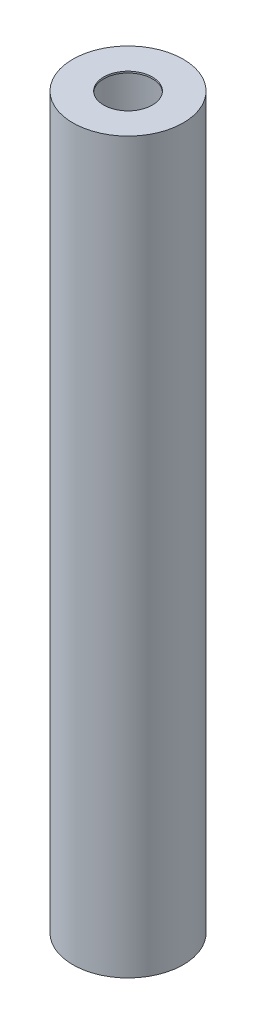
ISO-10303-21;
HEADER;
FILE_DESCRIPTION(('STEP AP214'),'2;1');
FILE_NAME('part.step','',(''),(''),'','','');
FILE_SCHEMA(('AUTOMOTIVE_DESIGN { 1 0 10303 214 1 1 1 1 }'));
ENDSEC;
DATA;
#1=APPLICATION_CONTEXT('core data for automotive mechanical design processes');
#2=APPLICATION_PROTOCOL_DEFINITION('international standard','automotive_design',2000,#1);
#3=PRODUCT_CONTEXT('',#1,'mechanical');
#4=PRODUCT('Part','Part','',(#3));
#5=PRODUCT_RELATED_PRODUCT_CATEGORY('part','',(#4));
#6=PRODUCT_DEFINITION_FORMATION('','',#4);
#7=PRODUCT_DEFINITION_CONTEXT('part definition',#1,'design');
#8=PRODUCT_DEFINITION('design','',#6,#7);
#9=PRODUCT_DEFINITION_SHAPE('','',#8);
#10=(LENGTH_UNIT() NAMED_UNIT(*) SI_UNIT(.MILLI.,.METRE.));
#11=(NAMED_UNIT(*) PLANE_ANGLE_UNIT() SI_UNIT($,.RADIAN.));
#12=(NAMED_UNIT(*) SI_UNIT($,.STERADIAN.) SOLID_ANGLE_UNIT());
#13=UNCERTAINTY_MEASURE_WITH_UNIT(LENGTH_MEASURE(1.E-05),#10,'distance_accuracy_value','');
#14=(GEOMETRIC_REPRESENTATION_CONTEXT(3) GLOBAL_UNCERTAINTY_ASSIGNED_CONTEXT((#13)) GLOBAL_UNIT_ASSIGNED_CONTEXT((#10,
#11,#12)) REPRESENTATION_CONTEXT('',''));
#15=CARTESIAN_POINT('',(0.,0.,0.));
#16=DIRECTION('',(0.,0.,1.));
#17=DIRECTION('',(1.,0.,0.));
#18=AXIS2_PLACEMENT_3D('',#15,#16,#17);
#19=CARTESIAN_POINT('',(0.,0.,0.));
#20=DIRECTION('',(0.,-1.,0.));
#21=DIRECTION('',(0.,0.,-1.));
#22=AXIS2_PLACEMENT_3D('',#19,#20,#21);
#23=CYLINDRICAL_SURFACE('',#22,7.62);
#24=CARTESIAN_POINT('',(0.,0.508,0.));
#25=DIRECTION('',(0.,-1.,0.));
#26=DIRECTION('',(0.,0.,-1.));
#27=AXIS2_PLACEMENT_3D('',#24,#25,#26);
#28=CIRCLE('',#27,7.62);
#29=CARTESIAN_POINT('',(0.,0.508,-7.62));
#30=VERTEX_POINT('',#29);
#31=EDGE_CURVE('E10',#30,#30,#28,.T.);
#32=ORIENTED_EDGE('',*,*,#31,.F.);
#33=EDGE_LOOP('',(#32));
#34=FACE_BOUND('',#33,.T.);
#35=CARTESIAN_POINT('',(0.,0.,0.));
#36=DIRECTION('',(0.,-1.,0.));
#37=DIRECTION('',(0.,0.,-1.));
#38=AXIS2_PLACEMENT_3D('',#35,#36,#37);
#39=CIRCLE('',#38,7.62);
#40=CARTESIAN_POINT('',(0.,0.,-7.62));
#41=VERTEX_POINT('',#40);
#42=EDGE_CURVE('E60',#41,#41,#39,.T.);
#43=ORIENTED_EDGE('',*,*,#42,.T.);
#44=EDGE_LOOP('',(#43));
#45=FACE_BOUND('',#44,.T.);
#46=ADVANCED_FACE('F32',(#34,#45),#23,.F.);
#47=CARTESIAN_POINT('',(-7.62,0.507999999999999,0.));
#48=DIRECTION('',(0.,-1.,0.));
#49=DIRECTION('',(0.,0.,-1.));
#50=AXIS2_PLACEMENT_3D('',#47,#48,#49);
#51=PLANE('',#50);
#52=CARTESIAN_POINT('',(0.,0.507999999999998,0.));
#53=DIRECTION('',(0.,-1.,0.));
#54=DIRECTION('',(0.,0.,-1.));
#55=AXIS2_PLACEMENT_3D('',#52,#53,#54);
#56=CIRCLE('',#55,16.764);
#57=CARTESIAN_POINT('',(0.,0.507999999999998,-16.764));
#58=VERTEX_POINT('',#57);
#59=EDGE_CURVE('E38',#58,#58,#56,.T.);
#60=ORIENTED_EDGE('',*,*,#59,.F.);
#61=EDGE_LOOP('',(#60));
#62=FACE_BOUND('',#61,.T.);
#63=ORIENTED_EDGE('',*,*,#31,.T.);
#64=EDGE_LOOP('',(#63));
#65=FACE_BOUND('',#64,.T.);
#66=ADVANCED_FACE('F97',(#62,#65),#51,.F.);
#67=CARTESIAN_POINT('',(0.,0.,0.));
#68=DIRECTION('',(0.,-1.,0.));
#69=DIRECTION('',(0.,0.,-1.));
#70=AXIS2_PLACEMENT_3D('',#67,#68,#69);
#71=CYLINDRICAL_SURFACE('',#70,16.764);
#72=CARTESIAN_POINT('',(0.,227.584,0.));
#73=DIRECTION('',(0.,-1.,0.));
#74=DIRECTION('',(0.,0.,-1.));
#75=AXIS2_PLACEMENT_3D('',#72,#73,#74);
#76=CIRCLE('',#75,16.764);
#77=CARTESIAN_POINT('',(0.,227.584,-16.764));
#78=VERTEX_POINT('',#77);
#79=EDGE_CURVE('E42',#78,#78,#76,.T.);
#80=ORIENTED_EDGE('',*,*,#79,.F.);
#81=EDGE_LOOP('',(#80));
#82=FACE_BOUND('',#81,.T.);
#83=ORIENTED_EDGE('',*,*,#59,.T.);
#84=EDGE_LOOP('',(#83));
#85=FACE_BOUND('',#84,.T.);
#86=ADVANCED_FACE('F92',(#82,#85),#71,.F.);
#87=CARTESIAN_POINT('',(-16.764,227.584,0.));
#88=DIRECTION('',(0.,1.,0.));
#89=DIRECTION('',(0.,0.,1.));
#90=AXIS2_PLACEMENT_3D('',#87,#88,#89);
#91=PLANE('',#90);
#92=CARTESIAN_POINT('',(0.,227.584,0.));
#93=DIRECTION('',(0.,-1.,0.));
#94=DIRECTION('',(0.,0.,-1.));
#95=AXIS2_PLACEMENT_3D('',#92,#93,#94);
#96=CIRCLE('',#95,7.62);
#97=CARTESIAN_POINT('',(0.,227.584,-7.62));
#98=VERTEX_POINT('',#97);
#99=EDGE_CURVE('E46',#98,#98,#96,.T.);
#100=ORIENTED_EDGE('',*,*,#99,.F.);
#101=EDGE_LOOP('',(#100));
#102=FACE_BOUND('',#101,.T.);
#103=ORIENTED_EDGE('',*,*,#79,.T.);
#104=EDGE_LOOP('',(#103));
#105=FACE_BOUND('',#104,.T.);
#106=ADVANCED_FACE('F86',(#102,#105),#91,.F.);
#107=CARTESIAN_POINT('',(0.,0.,0.));
#108=DIRECTION('',(0.,-1.,0.));
#109=DIRECTION('',(0.,0.,-1.));
#110=AXIS2_PLACEMENT_3D('',#107,#108,#109);
#111=CYLINDRICAL_SURFACE('',#110,7.62);
#112=CARTESIAN_POINT('',(0.,228.092,0.));
#113=DIRECTION('',(0.,-1.,0.));
#114=DIRECTION('',(0.,0.,-1.));
#115=AXIS2_PLACEMENT_3D('',#112,#113,#114);
#116=CIRCLE('',#115,7.62);
#117=CARTESIAN_POINT('',(0.,228.092,-7.62));
#118=VERTEX_POINT('',#117);
#119=EDGE_CURVE('E51',#118,#118,#116,.T.);
#120=ORIENTED_EDGE('',*,*,#119,.F.);
#121=EDGE_LOOP('',(#120));
#122=FACE_BOUND('',#121,.T.);
#123=ORIENTED_EDGE('',*,*,#99,.T.);
#124=EDGE_LOOP('',(#123));
#125=FACE_BOUND('',#124,.T.);
#126=ADVANCED_FACE('F80',(#122,#125),#111,.F.);
#127=CARTESIAN_POINT('',(-7.62,228.092,0.));
#128=DIRECTION('',(0.,-1.,0.));
#129=DIRECTION('',(0.,0.,-1.));
#130=AXIS2_PLACEMENT_3D('',#127,#128,#129);
#131=PLANE('',#130);
#132=CARTESIAN_POINT('',(0.,228.092,0.));
#133=DIRECTION('',(0.,-1.,0.));
#134=DIRECTION('',(0.,0.,-1.));
#135=AXIS2_PLACEMENT_3D('',#132,#133,#134);
#136=CIRCLE('',#135,17.272);
#137=CARTESIAN_POINT('',(0.,228.092,-17.272));
#138=VERTEX_POINT('',#137);
#139=EDGE_CURVE('E54',#138,#138,#136,.T.);
#140=ORIENTED_EDGE('',*,*,#139,.F.);
#141=EDGE_LOOP('',(#140));
#142=FACE_BOUND('',#141,.T.);
#143=ORIENTED_EDGE('',*,*,#119,.T.);
#144=EDGE_LOOP('',(#143));
#145=FACE_BOUND('',#144,.T.);
#146=ADVANCED_FACE('F74',(#142,#145),#131,.F.);
#147=CARTESIAN_POINT('',(0.,0.,0.));
#148=DIRECTION('',(0.,-1.,0.));
#149=DIRECTION('',(0.,0.,-1.));
#150=AXIS2_PLACEMENT_3D('',#147,#148,#149);
#151=CYLINDRICAL_SURFACE('',#150,17.272);
#152=CARTESIAN_POINT('',(0.,0.,0.));
#153=DIRECTION('',(0.,-1.,0.));
#154=DIRECTION('',(0.,0.,-1.));
#155=AXIS2_PLACEMENT_3D('',#152,#153,#154);
#156=CIRCLE('',#155,17.272);
#157=CARTESIAN_POINT('',(0.,0.,-17.272));
#158=VERTEX_POINT('',#157);
#159=EDGE_CURVE('E57',#158,#158,#156,.T.);
#160=ORIENTED_EDGE('',*,*,#159,.F.);
#161=EDGE_LOOP('',(#160));
#162=FACE_BOUND('',#161,.T.);
#163=ORIENTED_EDGE('',*,*,#139,.T.);
#164=EDGE_LOOP('',(#163));
#165=FACE_BOUND('',#164,.T.);
#166=ADVANCED_FACE('F68',(#162,#165),#151,.T.);
#167=CARTESIAN_POINT('',(-17.272,0.,0.));
#168=DIRECTION('',(0.,1.,0.));
#169=DIRECTION('',(0.,0.,1.));
#170=AXIS2_PLACEMENT_3D('',#167,#168,#169);
#171=PLANE('',#170);
#172=ORIENTED_EDGE('',*,*,#42,.F.);
#173=EDGE_LOOP('',(#172));
#174=FACE_BOUND('',#173,.T.);
#175=ORIENTED_EDGE('',*,*,#159,.T.);
#176=EDGE_LOOP('',(#175));
#177=FACE_BOUND('',#176,.T.);
#178=ADVANCED_FACE('F65',(#174,#177),#171,.F.);
#179=CLOSED_SHELL('',(#46,#66,#86,#106,#126,#146,#166,#178));
#180=MANIFOLD_SOLID_BREP('B2',#179);
#181=ADVANCED_BREP_SHAPE_REPRESENTATION('',(#18,#180),#14);
#182=SHAPE_DEFINITION_REPRESENTATION(#9,#181);
ENDSEC;
END-ISO-10303-21;
